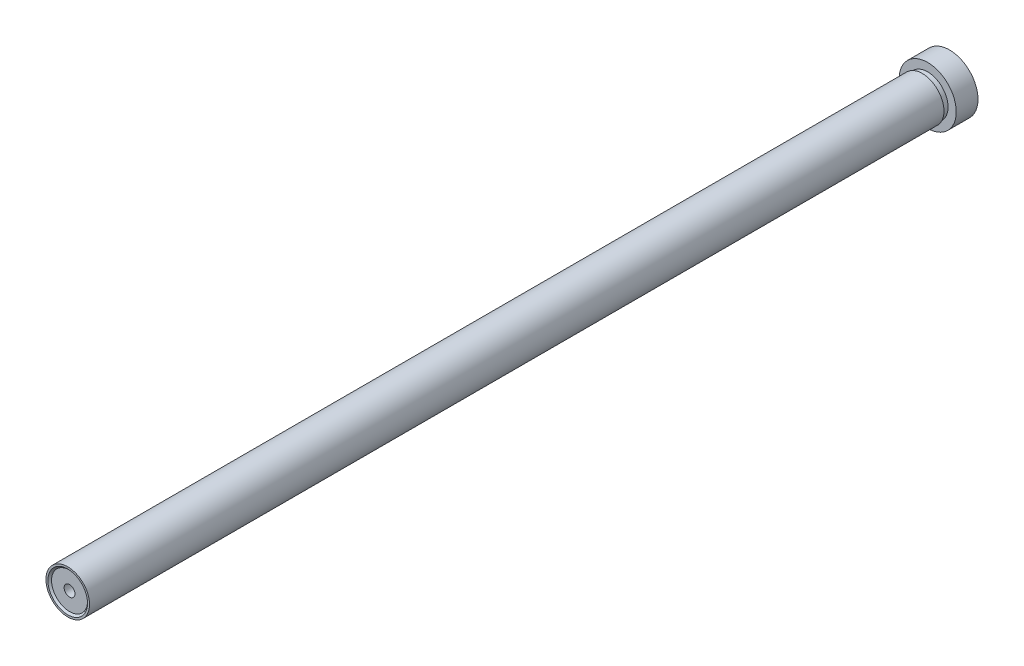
from build123d import *

# Parameters (mm, degrees)
SKETCH_1_R          = 10.5
EXTRUDE_1_DEPTH     = 8
SKETCH_2_R          = 7.5
EXTRUDE_2_DEPTH     = 2
SKETCH_3_R          = 8
EXTRUDE_3_DEPTH     = 314
SKETCH_4_R          = 2.75
CUT_EXTRUDE_1_DEPTH = 313
SKETCH_5_R          = 8.1
SKETCH_5_R_2        = 5.1
CUT_EXTRUDE_2_DEPTH = 1.9
SKETCH_6_R          = 7.285
CUT_EXTRUDE_3_DEPTH = 0.67
CUT_EXTRUDE_3_DRAFT = -45
SKETCH_7_R          = 2
CUT_EXTRUDE_4_DEPTH = 3


with BuildPart() as part:
    # Sketch 1 → Extrude 1 (new body)
    with BuildSketch(Plane.XY):
        Circle(SKETCH_1_R)
    extrude(amount=EXTRUDE_1_DEPTH)

    # Sketch 2 → Extrude 2 (add)
    with BuildSketch(Plane.XY.offset(8)):
        Circle(SKETCH_2_R)
    extrude(amount=EXTRUDE_2_DEPTH)

    # Sketch 3 → Extrude 3 (add)
    with BuildSketch(Plane.XY.offset(10)):
        Circle(SKETCH_3_R)
    extrude(amount=EXTRUDE_3_DEPTH)

    # Sketch 4 → Cut-Extrude 1 (cut)
    with BuildSketch(Plane(origin=(0, 0, 0), x_dir=(-1, 0, 0), z_dir=(0, 0, -1))):
        Circle(SKETCH_4_R)
    extrude(amount=-CUT_EXTRUDE_1_DEPTH, mode=Mode.SUBTRACT)

    # Sketch 5 → Cut-Extrude 2 (cut)
    with BuildSketch(Plane(origin=(0, 0, 0), x_dir=(-1, 0, 0), z_dir=(0, 0, -1))):
        Circle(SKETCH_5_R)
        Circle(SKETCH_5_R_2, mode=Mode.SUBTRACT)
    extrude(amount=-CUT_EXTRUDE_2_DEPTH, mode=Mode.SUBTRACT)


with BuildPart() as cut_extrude_3_tool:
    # Sketch 6 → Cut-Extrude 3 (with draft: the straight prism first)
    with BuildSketch(Plane.XY.offset(324)):
        Circle(SKETCH_6_R)
    extrude(amount=-CUT_EXTRUDE_3_DEPTH)
    # Cut-Extrude 3: the draft: its side faces are tilted about the plane it starts from
    cut_extrude_3_sides = [cut_extrude_3_tool.faces().sort_by_distance(p)[0] for p in [
        (-7.285, 0, 323.665),
    ]]
    draft(cut_extrude_3_sides, Plane.XY.offset(324), CUT_EXTRUDE_3_DRAFT)


with BuildPart() as part_1:
    add(part.part)

    # Cut-Extrude 3: cut by cut_extrude_3_tool
    add(cut_extrude_3_tool.part, mode=Mode.SUBTRACT)

    # Sketch 7 → Cut-Extrude 4 (cut)
    with BuildSketch(Plane.XY.offset(323.33)):
        Circle(SKETCH_7_R)
    extrude(amount=-CUT_EXTRUDE_4_DEPTH, mode=Mode.SUBTRACT)

    # Cut-Extrude 5 cone 1 section (on through the dimple's axis) → Cut-Extrude 5 (revolve, cut)
    with BuildSketch(Plane(origin=(0, 0, 320.33), x_dir=(0, -1, 0), z_dir=(1, 0, 0))):
        Polygon((0, 0), (2, 0), (0, 1.154700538), align=None)
    revolve(axis=Axis((0, 0, 320.33), (0, 0, -1)), mode=Mode.SUBTRACT)

    # Cut-Extrude 6 cone 1 section (on through the dimple's axis) → Cut-Extrude 6 (revolve, cut)
    with BuildSketch(Plane(origin=(0, 0, 313), x_dir=(0, 1, 0), z_dir=(1, 0, 0))):
        Polygon((0, 0), (2.75, 0), (0, 1.58771324), align=None)
    revolve(axis=Axis((0, 0, 313), (0, 0, 1)), mode=Mode.SUBTRACT)


solid = part_1.part
